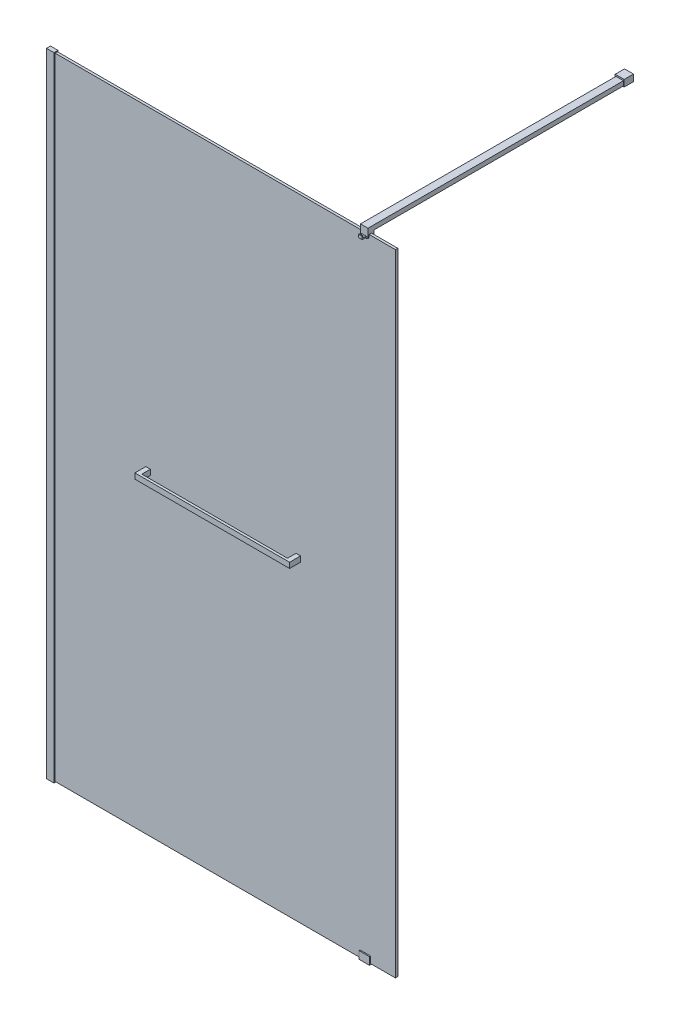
from build123d import *

# Parameters (mm, degrees)
DODANIE_WYCI_GNI_CIE1_DEPTH     = 2100
SZKIC2_W                        = 1147
SZKIC2_H                        = 8
DODANIE_WYCI_GNI_CIE2_DEPTH     = 2100
SZKIC4_W                        = 25
SZKIC4_H                        = 13.3
DODANIE_WYCI_GNI_CIE3_DEPTH     = 3
SZKIC5_W                        = 25
SZKIC5_H                        = 13.3
DODANIE_WYCI_GNI_CIE4_DEPTH     = 3
DODANIE_WYCI_GNI_CIE5_DEPTH     = 17.5
DODANIE_WYCI_GNI_CIE6_DEPTH     = 12.5
WYTNIJ_WYCI_GNI_CIE1_DEPTH      = 2402.039725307
WYTNIJ_WYCI_GNI_CIE1_DEPTH_BACK = 2402.039725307
SZKIC10_W                       = 25
SZKIC10_H                       = 861.63
DODANIE_WYCI_GNI_CIE7_DEPTH     = 15
SZKIC14_W                       = 30
SZKIC14_H                       = 22
DODANIE_WYCI_GNI_CIE8_DEPTH     = 31
POLKA_1A_DEPTH                  = 36.5
POLKA_1A_DEPTH_BACK             = 31
SZKIC17_W                       = 15
SZKIC17_H                       = 18
POLKA_1A_2_DEPTH                = 36.5
POLKA_1A_2_DEPTH_BACK           = 31
POLKA_1B_START                  = -515
SZKIC18_W                       = 12.8
SZKIC18_H                       = 8
POLKA_1B_DEPTH                  = 515
POLKA_1C_START                  = -5.28
SZKIC19_W                       = 515
SZKIC19_H                       = 80
POLKA_1C_DEPTH                  = 8
SZKIC20_W                       = 8
SZKIC20_H                       = 18
POLKA_1D_DEPTH                  = 485


with BuildPart() as part:
    # Szkic1 → Dodanie-wyci_gni_cie1 (new body)
    with BuildSketch(Plane(origin=(0, 0, 0), x_dir=(1, 0, 0), z_dir=(0, 1, 0))):
        Polygon((0, 0), (0, 13.3), (25, 13.3), (25, 11.4), (11.45, 11.4), (11.45, 3.4), (25, 3.4), (25, 0), align=None)
    extrude(amount=DODANIE_WYCI_GNI_CIE1_DEPTH)

    # Szkic4 → Dodanie-wyci_gni_cie3 (add)
    with BuildSketch(Plane(origin=(0, 2100, 0), x_dir=(1, 0, 0), z_dir=(0, 1, 0))):
        with Locations((12.5, 6.65)):
            Rectangle(SZKIC4_W, SZKIC4_H)
    extrude(amount=DODANIE_WYCI_GNI_CIE3_DEPTH)

    # Szkic5 → Dodanie-wyci_gni_cie4 (add)
    with BuildSketch(Plane.XZ):
        with Locations((12.5, -6.65)):
            Rectangle(SZKIC5_W, SZKIC5_H)
    extrude(amount=DODANIE_WYCI_GNI_CIE4_DEPTH)


with BuildPart() as body_2:
    # Szkic2 → Dodanie-wyci_gni_cie2 (new body)
    with BuildSketch(Plane.XZ):
        with Locations((584.95, -7.4)):
            Rectangle(SZKIC2_W, SZKIC2_H)
    extrude(amount=-DODANIE_WYCI_GNI_CIE2_DEPTH)


with BuildPart() as body_3:
    # Szkic6 → Dodanie-wyci_gni_cie5 (new, symmetric)
    with BuildSketch(Plane(origin=(1058.45, 0, 0), x_dir=(0, 0, -1), z_dir=(1, 0, 0))):
        Polygon((11.4, 22), (15.75, 22), (15.75, -3), (-0.35, -3), (-0.35, 22), (3.4, 22), (3.4, 0), (11.4, 0), align=None)
    extrude(amount=DODANIE_WYCI_GNI_CIE5_DEPTH, both=True)


with BuildPart() as body_4:
    # Szkic7 → Dodanie-wyci_gni_cie6 (new, symmetric)
    with BuildSketch(Plane(origin=(1058.45, 0, 0), x_dir=(0, 0, -1), z_dir=(1, 0, 0))):
        Polygon((-0.6, 2120), (19.4, 2120), (19.4, 2090), (11.4, 2090), (11.4, 2100), (3.4, 2100), (3.4, 2090), (-13.37, 2090), (-13.37, 2100), (-10.37, 2100), (-9.845068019, 2094), (-0.6, 2094), align=None)
    extrude(amount=DODANIE_WYCI_GNI_CIE6_DEPTH, both=True)

    # Szkic8 → Wytnij-wyci_gni_cie1 (cut, two sides: drawn at the far end of the back side and taken through both)
    with BuildSketch(Plane(origin=(0, 2100, 0), x_dir=(1, 0, 0), z_dir=(0, 1, 0)).offset(-WYTNIJ_WYCI_GNI_CIE1_DEPTH_BACK)):
        Polygon((-904.672203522, 908.990071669), (1045.95, -0.6), (1052.45, -3.630999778), (1052.45, -13.37), (1064.45, -13.37), (1064.45, -3.630999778), (1070.95, -0.6), (3021.572203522, 908.990071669), (3021.572203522, -3395.556863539), (-904.672203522, -3395.556863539), align=None)
    extrude(amount=WYTNIJ_WYCI_GNI_CIE1_DEPTH + WYTNIJ_WYCI_GNI_CIE1_DEPTH_BACK, mode=Mode.SUBTRACT)

    # Szkic10 → Dodanie-wyci_gni_cie7 (add)
    with BuildSketch(Plane(origin=(0, 2120, 0), x_dir=(1, 0, 0), z_dir=(0, 1, 0))):
        with Locations((1058.45, 450.215)):
            Rectangle(SZKIC10_W, SZKIC10_H)
    extrude(amount=-DODANIE_WYCI_GNI_CIE7_DEPTH)

    # Szkic14 → Dodanie-wyci_gni_cie8 (add)
    with BuildSketch(Plane(origin=(0, 0, -881.03), x_dir=(-1, 0, 0), z_dir=(0, 0, -1))):
        with Locations((-1058.45, 2114)):
            Rectangle(SZKIC14_W, SZKIC14_H)
    extrude(amount=-DODANIE_WYCI_GNI_CIE8_DEPTH)


with BuildPart() as body_5:
    # Szkic17 → polka_1a (new, two sides: drawn at the far end of the back side and taken through both)
    with BuildSketch(Plane.XY.offset(-3.4).offset(-POLKA_1A_DEPTH_BACK)):
        with Locations((334.95, 1050)):
            Rectangle(SZKIC17_W, SZKIC17_H)
    extrude(amount=POLKA_1A_DEPTH + POLKA_1A_DEPTH_BACK)


with BuildPart() as body_6:
    # Szkic17 → polka_1a 2 (new, two sides: drawn at the far end of the back side and taken through both)
    with BuildSketch(Plane.XY.offset(-3.4).offset(-POLKA_1A_2_DEPTH_BACK)):
        with Locations((834.95, 1050)):
            Rectangle(SZKIC17_W, SZKIC17_H)
    extrude(amount=POLKA_1A_2_DEPTH + POLKA_1A_2_DEPTH_BACK)


with BuildPart() as polka_1b_tool:
    # Szkic18 → polka_1b (new body)
    with BuildSketch(Plane.ZY.offset(-327.45).offset(POLKA_1B_START)):
        with Locations((-28, 1049.73)):
            Rectangle(SZKIC18_W, SZKIC18_H)
    extrude(amount=POLKA_1B_DEPTH)


with BuildPart() as body_5_1:
    add(body_5.part)

    # polka_1b: cut by polka_1b_tool
    add(polka_1b_tool.part, mode=Mode.SUBTRACT)



with BuildPart() as body_6_1:
    add(body_6.part)

    # polka_1b: cut by polka_1b_tool
    add(polka_1b_tool.part, mode=Mode.SUBTRACT)


with BuildPart() as body_7:
    # Szkic19 → polka_1c (new body)
    with BuildSketch(Plane(origin=(0, 1059, 0), x_dir=(1, 0, 0), z_dir=(0, 1, 0)).offset(POLKA_1C_START)):
        with Locations((584.95, 61.6)):
            Rectangle(SZKIC19_W, SZKIC19_H)
    extrude(amount=-POLKA_1C_DEPTH)


with BuildPart() as body_5_2:
    add(body_5_1.part)

    add(body_6_1.part)  # polka_1d merges body 6
    # Szkic20 → polka_1d (add)
    with BuildSketch(Plane(origin=(342.45, 0, 0), x_dir=(0, 0, -1), z_dir=(1, 0, 0))):
        with Locations((-29.1, 1050)):
            Rectangle(SZKIC20_W, SZKIC20_H)
    extrude(amount=POLKA_1D_DEPTH)


solid = Compound([part.part, body_2.part, body_3.part, body_4.part, body_7.part, body_5_2.part])
